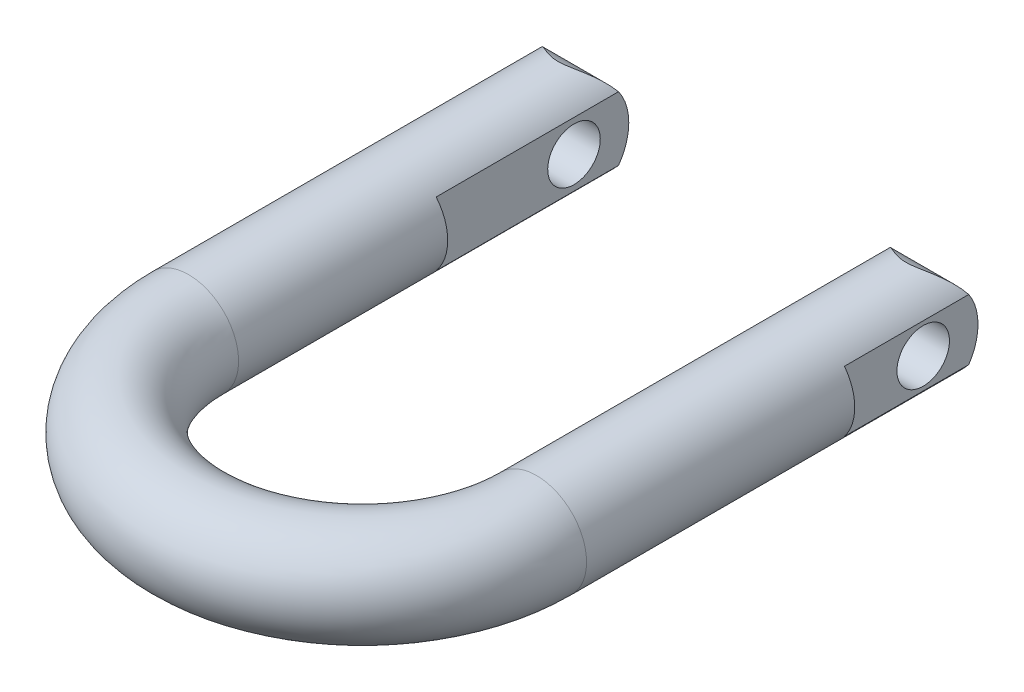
ISO-10303-21;
HEADER;
FILE_DESCRIPTION(('STEP AP214'),'2;1');
FILE_NAME('part.step','',(''),(''),'','','');
FILE_SCHEMA(('AUTOMOTIVE_DESIGN { 1 0 10303 214 1 1 1 1 }'));
ENDSEC;
DATA;
#1=APPLICATION_CONTEXT('core data for automotive mechanical design processes');
#2=APPLICATION_PROTOCOL_DEFINITION('international standard','automotive_design',2000,#1);
#3=PRODUCT_CONTEXT('',#1,'mechanical');
#4=PRODUCT('Part','Part','',(#3));
#5=PRODUCT_RELATED_PRODUCT_CATEGORY('part','',(#4));
#6=PRODUCT_DEFINITION_FORMATION('','',#4);
#7=PRODUCT_DEFINITION_CONTEXT('part definition',#1,'design');
#8=PRODUCT_DEFINITION('design','',#6,#7);
#9=PRODUCT_DEFINITION_SHAPE('','',#8);
#10=(LENGTH_UNIT() NAMED_UNIT(*) SI_UNIT(.MILLI.,.METRE.));
#11=(NAMED_UNIT(*) PLANE_ANGLE_UNIT() SI_UNIT($,.RADIAN.));
#12=(NAMED_UNIT(*) SI_UNIT($,.STERADIAN.) SOLID_ANGLE_UNIT());
#13=UNCERTAINTY_MEASURE_WITH_UNIT(LENGTH_MEASURE(1.E-05),#10,'distance_accuracy_value','');
#14=(GEOMETRIC_REPRESENTATION_CONTEXT(3) GLOBAL_UNCERTAINTY_ASSIGNED_CONTEXT((#13)) GLOBAL_UNIT_ASSIGNED_CONTEXT((#10,
#11,#12)) REPRESENTATION_CONTEXT('',''));
#15=CARTESIAN_POINT('',(0.,0.,0.));
#16=DIRECTION('',(0.,0.,1.));
#17=DIRECTION('',(1.,0.,0.));
#18=AXIS2_PLACEMENT_3D('',#15,#16,#17);
#19=CARTESIAN_POINT('',(40.165,-20.,-10.6));
#20=DIRECTION('',(1.,0.,0.));
#21=DIRECTION('',(0.,1.,0.));
#22=AXIS2_PLACEMENT_3D('',#19,#20,#21);
#23=PLANE('',#22);
#24=DIRECTION('',(0.,1.,0.));
#25=VECTOR('',#24,1.);
#26=CARTESIAN_POINT('',(40.165,-20.,14.8));
#27=LINE('',#26,#25);
#28=CARTESIAN_POINT('',(40.165,-5.71259792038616,14.8));
#29=VERTEX_POINT('',#28);
#30=CARTESIAN_POINT('',(40.165,5.71259792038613,14.8));
#31=VERTEX_POINT('',#30);
#32=EDGE_CURVE('E181',#29,#31,#27,.T.);
#33=ORIENTED_EDGE('',*,*,#32,.F.);
#34=DIRECTION('',(0.,0.,-1.));
#35=VECTOR('',#34,1.);
#36=CARTESIAN_POINT('',(40.165,-5.71259792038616,67.3));
#37=LINE('',#36,#35);
#38=CARTESIAN_POINT('',(40.165,-5.71259792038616,-8.57066070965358));
#39=VERTEX_POINT('',#38);
#40=EDGE_CURVE('E126',#39,#29,#37,.F.);
#41=ORIENTED_EDGE('',*,*,#40,.F.);
#42=CARTESIAN_POINT('',(40.165,0.,0.));
#43=DIRECTION('',(1.,0.,0.));
#44=DIRECTION('',(0.,1.,0.));
#45=AXIS2_PLACEMENT_3D('',#42,#43,#44);
#46=CIRCLE('',#45,10.3);
#47=CARTESIAN_POINT('',(40.165,5.71259792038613,-8.5706607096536));
#48=VERTEX_POINT('',#47);
#49=EDGE_CURVE('E118',#39,#48,#46,.T.);
#50=ORIENTED_EDGE('',*,*,#49,.T.);
#51=DIRECTION('',(0.,0.,-1.));
#52=VECTOR('',#51,1.);
#53=CARTESIAN_POINT('',(40.165,5.71259792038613,67.3));
#54=LINE('',#53,#52);
#55=EDGE_CURVE('E179',#31,#48,#54,.T.);
#56=ORIENTED_EDGE('',*,*,#55,.F.);
#57=EDGE_LOOP('',(#33,#41,#50,#56));
#58=FACE_BOUND('',#57,.T.);
#59=CARTESIAN_POINT('',(40.165,0.,0.));
#60=DIRECTION('',(-1.,0.,0.));
#61=DIRECTION('',(0.,0.,1.));
#62=AXIS2_PLACEMENT_3D('',#59,#60,#61);
#63=CIRCLE('',#62,4.94);
#64=CARTESIAN_POINT('',(40.165,0.,4.94));
#65=VERTEX_POINT('',#64);
#66=EDGE_CURVE('E165',#65,#65,#63,.T.);
#67=ORIENTED_EDGE('',*,*,#66,.T.);
#68=EDGE_LOOP('',(#67));
#69=FACE_BOUND('',#68,.T.);
#70=ADVANCED_FACE('F14',(#58,#69),#23,.T.);
#71=CARTESIAN_POINT('',(25.465,20.,25.9));
#72=DIRECTION('',(1.,0.,0.));
#73=DIRECTION('',(0.,1.,0.));
#74=AXIS2_PLACEMENT_3D('',#71,#72,#73);
#75=PLANE('',#74);
#76=CARTESIAN_POINT('',(25.465,0.,0.));
#77=DIRECTION('',(-1.,0.,0.));
#78=DIRECTION('',(0.,-1.,0.));
#79=AXIS2_PLACEMENT_3D('',#76,#77,#78);
#80=CIRCLE('',#79,4.94);
#81=CARTESIAN_POINT('',(25.465,-4.94,0.));
#82=VERTEX_POINT('',#81);
#83=EDGE_CURVE('E162',#82,#82,#80,.T.);
#84=ORIENTED_EDGE('',*,*,#83,.F.);
#85=EDGE_LOOP('',(#84));
#86=FACE_BOUND('',#85,.T.);
#87=CARTESIAN_POINT('',(25.465,0.,0.));
#88=DIRECTION('',(1.,0.,0.));
#89=DIRECTION('',(0.,1.,0.));
#90=AXIS2_PLACEMENT_3D('',#87,#88,#89);
#91=CIRCLE('',#90,10.3);
#92=CARTESIAN_POINT('',(25.465,-6.00123112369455,-8.37109461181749));
#93=VERTEX_POINT('',#92);
#94=CARTESIAN_POINT('',(25.465,6.00123112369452,-8.37109461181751));
#95=VERTEX_POINT('',#94);
#96=EDGE_CURVE('E24',#93,#95,#91,.T.);
#97=ORIENTED_EDGE('',*,*,#96,.F.);
#98=DIRECTION('',(0.,0.,-1.));
#99=VECTOR('',#98,1.);
#100=CARTESIAN_POINT('',(25.465,-6.00123112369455,67.3));
#101=LINE('',#100,#99);
#102=CARTESIAN_POINT('',(25.465,-6.00123112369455,25.9));
#103=VERTEX_POINT('',#102);
#104=EDGE_CURVE('E167',#93,#103,#101,.F.);
#105=ORIENTED_EDGE('',*,*,#104,.T.);
#106=DIRECTION('',(0.,1.,0.));
#107=VECTOR('',#106,1.);
#108=CARTESIAN_POINT('',(25.465,-20.,25.9));
#109=LINE('',#108,#107);
#110=CARTESIAN_POINT('',(25.465,6.00123112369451,25.9));
#111=VERTEX_POINT('',#110);
#112=EDGE_CURVE('E168',#103,#111,#109,.T.);
#113=ORIENTED_EDGE('',*,*,#112,.T.);
#114=DIRECTION('',(0.,0.,-1.));
#115=VECTOR('',#114,1.);
#116=CARTESIAN_POINT('',(25.465,6.00123112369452,67.3));
#117=LINE('',#116,#115);
#118=EDGE_CURVE('E177',#111,#95,#117,.T.);
#119=ORIENTED_EDGE('',*,*,#118,.T.);
#120=EDGE_LOOP('',(#97,#105,#113,#119));
#121=FACE_BOUND('',#120,.T.);
#122=ADVANCED_FACE('F136',(#86,#121),#75,.F.);
#123=CARTESIAN_POINT('',(32.7,0.,67.3));
#124=DIRECTION('',(0.,0.,-1.));
#125=DIRECTION('',(1.,0.,0.));
#126=AXIS2_PLACEMENT_3D('',#123,#124,#125);
#127=CYLINDRICAL_SURFACE('',#126,9.4);
#128=CARTESIAN_POINT('',(32.7,0.,65.2));
#129=DIRECTION('',(0.,0.,-1.));
#130=DIRECTION('',(-1.,0.,0.));
#131=AXIS2_PLACEMENT_3D('',#128,#129,#130);
#132=CIRCLE('',#131,9.4);
#133=CARTESIAN_POINT('',(42.1,0.,65.2));
#134=VERTEX_POINT('',#133);
#135=EDGE_CURVE('E9',#134,#134,#132,.F.);
#136=ORIENTED_EDGE('',*,*,#135,.F.);
#137=EDGE_LOOP('',(#136));
#138=FACE_BOUND('',#137,.T.);
#139=ORIENTED_EDGE('',*,*,#55,.T.);
#140=CARTESIAN_POINT('',(42.1,0.,-10.3));
#141=CARTESIAN_POINT('',(42.0999992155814,0.216897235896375,-10.299999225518));
#142=CARTESIAN_POINT('',(42.0924791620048,0.433805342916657,-10.2931349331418));
#143=CARTESIAN_POINT('',(42.0625521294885,0.865733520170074,-10.2658338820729));
#144=CARTESIAN_POINT('',(42.040144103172,1.08075345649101,-10.245396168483));
#145=CARTESIAN_POINT('',(41.9808762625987,1.50721883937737,-10.1913941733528));
#146=CARTESIAN_POINT('',(41.9440092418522,1.71866244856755,-10.1578233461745));
#147=CARTESIAN_POINT('',(41.8565179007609,2.13628254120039,-10.0782681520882));
#148=CARTESIAN_POINT('',(41.805893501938,2.34245899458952,-10.0322837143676));
#149=CARTESIAN_POINT('',(41.6921337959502,2.74688376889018,-9.92914389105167));
#150=CARTESIAN_POINT('',(41.6290833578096,2.94517547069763,-9.87206431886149));
#151=CARTESIAN_POINT('',(41.4911872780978,3.33431563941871,-9.74751751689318));
#152=CARTESIAN_POINT('',(41.4163372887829,3.52516133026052,-9.68004645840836));
#153=CARTESIAN_POINT('',(41.2558382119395,3.8985812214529,-9.53578156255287));
#154=CARTESIAN_POINT('',(41.1701893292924,4.08115557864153,-9.45898790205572));
#155=CARTESIAN_POINT('',(40.989035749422,4.43755176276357,-9.29712110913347));
#156=CARTESIAN_POINT('',(40.8935288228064,4.61137159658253,-9.21204610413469));
#157=CARTESIAN_POINT('',(40.6535187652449,5.01770116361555,-8.99912622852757));
#158=CARTESIAN_POINT('',(40.5047058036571,5.24585357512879,-8.86779237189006));
#159=CARTESIAN_POINT('',(40.1917278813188,5.68388185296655,-8.59361889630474));
#160=CARTESIAN_POINT('',(40.0275618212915,5.89375640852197,-8.45077845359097));
#161=CARTESIAN_POINT('',(39.6852676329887,6.29570269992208,-8.15575902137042));
#162=CARTESIAN_POINT('',(39.5071095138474,6.48773415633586,-8.00356013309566));
#163=CARTESIAN_POINT('',(39.1385307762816,6.85366806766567,-7.69252175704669));
#164=CARTESIAN_POINT('',(38.9481117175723,7.02757282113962,-7.5336831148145));
#165=CARTESIAN_POINT('',(38.5511551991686,7.36158208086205,-7.20783144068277));
#166=CARTESIAN_POINT('',(38.3443400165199,7.52125342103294,-7.04071367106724));
#167=CARTESIAN_POINT('',(37.9191259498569,7.82231549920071,-6.70464528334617));
#168=CARTESIAN_POINT('',(37.7007242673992,7.96370179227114,-6.53569423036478));
#169=CARTESIAN_POINT('',(37.2525679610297,8.22810501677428,-6.1995086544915));
#170=CARTESIAN_POINT('',(37.0228348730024,8.35115513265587,-6.03227155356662));
#171=CARTESIAN_POINT('',(36.5507764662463,8.5790568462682,-5.70348246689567));
#172=CARTESIAN_POINT('',(36.308458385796,8.68391875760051,-5.54192730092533));
#173=CARTESIAN_POINT('',(35.8136389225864,8.87322878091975,-5.23334914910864));
#174=CARTESIAN_POINT('',(35.5613971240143,8.95800840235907,-5.08611795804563));
#175=CARTESIAN_POINT('',(35.040169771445,9.10808419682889,-4.81217978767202));
#176=CARTESIAN_POINT('',(34.7711889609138,9.1733858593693,-4.68546703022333));
#177=CARTESIAN_POINT('',(34.2611933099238,9.27243230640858,-4.48580034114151));
#178=CARTESIAN_POINT('',(34.0231085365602,9.30964118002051,-4.40738476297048));
#179=CARTESIAN_POINT('',(33.6580389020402,9.35185345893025,-4.31670500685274));
#180=CARTESIAN_POINT('',(33.5351566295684,9.36365217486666,-4.29098176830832));
#181=CARTESIAN_POINT('',(33.2873596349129,9.38245268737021,-4.24971800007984));
#182=CARTESIAN_POINT('',(33.1624460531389,9.38945708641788,-4.23417194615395));
#183=CARTESIAN_POINT('',(32.9103095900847,9.39850185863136,-4.2140585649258));
#184=CARTESIAN_POINT('',(32.7830760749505,9.40049289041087,-4.20960036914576));
#185=CARTESIAN_POINT('',(32.5287590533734,9.39930037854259,-4.21226243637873));
#186=CARTESIAN_POINT('',(32.4016755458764,9.3961168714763,-4.21938261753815));
#187=CARTESIAN_POINT('',(32.1486647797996,9.38467327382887,-4.24477247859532));
#188=CARTESIAN_POINT('',(32.0227397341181,9.37640494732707,-4.26306024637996));
#189=CARTESIAN_POINT('',(31.7731680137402,9.35503621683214,-4.30975212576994));
#190=CARTESIAN_POINT('',(31.6495228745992,9.3419326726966,-4.33816281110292));
#191=CARTESIAN_POINT('',(31.2055925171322,9.28610737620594,-4.45725929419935));
#192=CARTESIAN_POINT('',(30.8937981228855,9.22995459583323,-4.57389542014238));
#193=CARTESIAN_POINT('',(30.4432094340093,9.12638679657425,-4.77544661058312));
#194=CARTESIAN_POINT('',(30.2955418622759,9.08853087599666,-4.84726047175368));
#195=CARTESIAN_POINT('',(30.0053380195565,9.00674403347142,-4.99758721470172));
#196=CARTESIAN_POINT('',(29.86280100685,8.96281399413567,-5.07609912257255));
#197=CARTESIAN_POINT('',(29.4473431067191,8.82409552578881,-5.31590803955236));
#198=CARTESIAN_POINT('',(29.1811443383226,8.72109263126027,-5.48407135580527));
#199=CARTESIAN_POINT('',(28.6639241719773,8.49410443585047,-5.82950413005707));
#200=CARTESIAN_POINT('',(28.412915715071,8.37010157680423,-6.00678112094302));
#201=CARTESIAN_POINT('',(27.9242429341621,8.10123433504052,-6.36476257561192));
#202=CARTESIAN_POINT('',(27.6865985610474,7.95633985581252,-6.54547165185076));
#203=CARTESIAN_POINT('',(27.2245756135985,7.64572836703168,-6.90575383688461));
#204=CARTESIAN_POINT('',(27.0001928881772,7.48001792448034,-7.08532728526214));
#205=CARTESIAN_POINT('',(26.5503556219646,7.1155584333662,-7.451846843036));
#206=CARTESIAN_POINT('',(26.3258323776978,6.91534122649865,-7.63848320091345));
#207=CARTESIAN_POINT('',(25.8933896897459,6.49014619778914,-8.0029012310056));
#208=CARTESIAN_POINT('',(25.6854749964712,6.26516133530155,-8.18068036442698));
#209=CARTESIAN_POINT('',(25.289149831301,5.79089739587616,-8.52295542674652));
#210=CARTESIAN_POINT('',(25.1006784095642,5.54169930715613,-8.68749248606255));
#211=CARTESIAN_POINT('',(24.7455256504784,5.01857682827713,-8.9998071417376));
#212=CARTESIAN_POINT('',(24.5788286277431,4.74467048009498,-9.14759679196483));
#213=CARTESIAN_POINT('',(24.3282024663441,4.27954972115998,-9.37097041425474));
#214=CARTESIAN_POINT('',(24.236563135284,4.09551120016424,-9.45295287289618));
#215=CARTESIAN_POINT('',(24.0643041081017,3.71855681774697,-9.60748628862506));
#216=CARTESIAN_POINT('',(23.9836810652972,3.52564367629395,-9.68004010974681));
#217=CARTESIAN_POINT('',(23.8345200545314,3.13170926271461,-9.81456560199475));
#218=CARTESIAN_POINT('',(23.765976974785,2.93069146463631,-9.87654174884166));
#219=CARTESIAN_POINT('',(23.6419685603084,2.52146188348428,-9.98885590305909));
#220=CARTESIAN_POINT('',(23.5865036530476,2.31324986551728,-10.0391935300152));
#221=CARTESIAN_POINT('',(23.4892593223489,1.88940879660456,-10.1275529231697));
#222=CARTESIAN_POINT('',(23.4475823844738,1.67373681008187,-10.1654824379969));
#223=CARTESIAN_POINT('',(23.3792808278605,1.2380650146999,-10.2276882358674));
#224=CARTESIAN_POINT('',(23.3526561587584,1.01806522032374,-10.2519645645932));
#225=CARTESIAN_POINT('',(23.3150220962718,0.57571082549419,-10.286289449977));
#226=CARTESIAN_POINT('',(23.3040066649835,0.353357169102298,-10.296343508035));
#227=CARTESIAN_POINT('',(23.2978136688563,-0.0917444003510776,-10.3019952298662));
#228=CARTESIAN_POINT('',(23.3026347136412,-0.314492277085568,-10.2975941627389));
#229=CARTESIAN_POINT('',(23.3266394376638,-0.73451388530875,-10.2756930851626));
#230=CARTESIAN_POINT('',(23.3442279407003,-0.931958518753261,-10.2596479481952));
#231=CARTESIAN_POINT('',(23.3916428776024,-1.32420678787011,-10.2164287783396));
#232=CARTESIAN_POINT('',(23.4214734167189,-1.51900951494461,-10.1892510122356));
#233=CARTESIAN_POINT('',(23.4928808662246,-1.90457083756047,-10.1242690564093));
#234=CARTESIAN_POINT('',(23.5344541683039,-2.09533065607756,-10.0864681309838));
#235=CARTESIAN_POINT('',(23.6287450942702,-2.47184559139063,-10.0008637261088));
#236=CARTESIAN_POINT('',(23.6814669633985,-2.65759877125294,-9.95305643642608));
#237=CARTESIAN_POINT('',(23.7988570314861,-3.02792993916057,-9.84681193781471));
#238=CARTESIAN_POINT('',(23.8638021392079,-3.2123495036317,-9.78812894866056));
#239=CARTESIAN_POINT('',(24.0038568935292,-3.57418276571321,-9.66188338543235));
#240=CARTESIAN_POINT('',(24.0789704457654,-3.75159373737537,-9.59431739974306));
#241=CARTESIAN_POINT('',(24.3183385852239,-4.27242065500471,-9.37961774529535));
#242=CARTESIAN_POINT('',(24.4966739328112,-4.60459532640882,-9.22043391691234));
#243=CARTESIAN_POINT('',(24.8364737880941,-5.15780573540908,-8.91966629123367));
#244=CARTESIAN_POINT('',(24.9912444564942,-5.38604134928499,-8.78343054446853));
#245=CARTESIAN_POINT('',(25.3163486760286,-5.82374254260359,-8.49953057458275));
#246=CARTESIAN_POINT('',(25.4866889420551,-6.03319994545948,-8.35186142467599));
#247=CARTESIAN_POINT('',(25.8415058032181,-6.43372820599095,-8.04739779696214));
#248=CARTESIAN_POINT('',(26.0260166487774,-6.6247518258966,-7.89058144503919));
#249=CARTESIAN_POINT('',(26.4074669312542,-6.98808960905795,-7.57067814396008));
#250=CARTESIAN_POINT('',(26.6044044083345,-7.16040671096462,-7.4075921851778));
#251=CARTESIAN_POINT('',(27.0147472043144,-7.49058815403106,-7.07371919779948));
#252=CARTESIAN_POINT('',(27.2284327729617,-7.64801133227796,-6.90284126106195));
#253=CARTESIAN_POINT('',(27.6678104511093,-7.94400885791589,-6.56003014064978));
#254=CARTESIAN_POINT('',(27.8935063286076,-8.08257724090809,-6.38809664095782));
#255=CARTESIAN_POINT('',(28.3567986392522,-8.34067094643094,-6.04721273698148));
#256=CARTESIAN_POINT('',(28.5943683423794,-8.46023671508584,-5.87825669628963));
#257=CARTESIAN_POINT('',(29.0830314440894,-8.68040055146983,-5.54796552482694));
#258=CARTESIAN_POINT('',(29.3341147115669,-8.78101258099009,-5.38662485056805));
#259=CARTESIAN_POINT('',(29.8326166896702,-8.95558230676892,-5.09065475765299));
#260=CARTESIAN_POINT('',(30.0788632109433,-9.03098474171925,-4.95492715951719));
#261=CARTESIAN_POINT('',(30.5873120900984,-9.16326994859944,-4.70577138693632));
#262=CARTESIAN_POINT('',(30.8495011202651,-9.22016794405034,-4.59232491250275));
#263=CARTESIAN_POINT('',(31.3460243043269,-9.30477633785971,-4.41803998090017));
#264=CARTESIAN_POINT('',(31.5777160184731,-9.33577116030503,-4.3515843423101));
#265=CARTESIAN_POINT('',(31.9317029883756,-9.36930045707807,-4.27865654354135));
#266=CARTESIAN_POINT('',(32.0506735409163,-9.37831430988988,-4.25881188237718));
#267=CARTESIAN_POINT('',(32.2900729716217,-9.39182106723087,-4.22894506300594));
#268=CARTESIAN_POINT('',(32.4105011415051,-9.39631608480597,-4.21891831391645));
#269=CARTESIAN_POINT('',(32.6526102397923,-9.40066523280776,-4.20921868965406));
#270=CARTESIAN_POINT('',(32.7742943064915,-9.4004904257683,-4.20961037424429));
#271=CARTESIAN_POINT('',(33.0170716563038,-9.39543553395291,-4.22087996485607));
#272=CARTESIAN_POINT('',(33.1381649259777,-9.3905553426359,-4.23175810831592));
#273=CARTESIAN_POINT('',(33.3789811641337,-9.37622340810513,-4.26341789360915));
#274=CARTESIAN_POINT('',(33.4987012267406,-9.366763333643,-4.28421758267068));
#275=CARTESIAN_POINT('',(33.7358433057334,-9.3435131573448,-4.33468917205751));
#276=CARTESIAN_POINT('',(33.8532643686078,-9.32972129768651,-4.36436467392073));
#277=CARTESIAN_POINT('',(34.13571258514,-9.29122873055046,-4.44588348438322));
#278=CARTESIAN_POINT('',(34.299283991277,-9.26439135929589,-4.50175807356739));
#279=CARTESIAN_POINT('',(34.6203347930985,-9.20320955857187,-4.62554800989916));
#280=CARTESIAN_POINT('',(34.7778105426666,-9.16886071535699,-4.69347043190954));
#281=CARTESIAN_POINT('',(35.0873754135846,-9.09317955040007,-4.83846984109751));
#282=CARTESIAN_POINT('',(35.2394447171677,-9.05182421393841,-4.91557674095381));
#283=CARTESIAN_POINT('',(35.5381490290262,-8.96265567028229,-5.07634572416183));
#284=CARTESIAN_POINT('',(35.684781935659,-8.91483999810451,-5.1600103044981));
#285=CARTESIAN_POINT('',(36.1097561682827,-8.76483836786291,-5.41343532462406));
#286=CARTESIAN_POINT('',(36.3812395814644,-8.65406611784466,-5.58965572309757));
#287=CARTESIAN_POINT('',(36.9085052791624,-8.41028051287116,-5.9501915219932));
#288=CARTESIAN_POINT('',(37.164274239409,-8.27724863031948,-6.13451357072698));
#289=CARTESIAN_POINT('',(37.6614976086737,-7.98912235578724,-6.50531138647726));
#290=CARTESIAN_POINT('',(37.9029498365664,-7.83402461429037,-6.69178747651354));
#291=CARTESIAN_POINT('',(38.3717294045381,-7.50159899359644,-7.06243545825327));
#292=CARTESIAN_POINT('',(38.5990628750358,-7.32428086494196,-7.24660832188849));
#293=CARTESIAN_POINT('',(39.0120720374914,-6.97010468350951,-7.58685275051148));
#294=CARTESIAN_POINT('',(39.1994356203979,-6.795862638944,-7.74359842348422));
#295=CARTESIAN_POINT('',(39.5620059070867,-6.42956288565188,-8.05032824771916));
#296=CARTESIAN_POINT('',(39.7372115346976,-6.23750360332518,-8.20031180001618));
#297=CARTESIAN_POINT('',(40.0737898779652,-5.83573285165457,-8.49091229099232));
#298=CARTESIAN_POINT('',(40.2351859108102,-5.62605237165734,-8.63154492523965));
#299=CARTESIAN_POINT('',(40.5426732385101,-5.18881924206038,-8.90124013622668));
#300=CARTESIAN_POINT('',(40.6887702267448,-4.96127329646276,-9.03030701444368));
#301=CARTESIAN_POINT('',(40.9305588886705,-4.54544323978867,-9.24498783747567));
#302=CARTESIAN_POINT('',(41.0299339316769,-4.36083839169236,-9.33359743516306));
#303=CARTESIAN_POINT('',(41.2175147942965,-3.98203110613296,-9.50138407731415));
#304=CARTESIAN_POINT('',(41.3057270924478,-3.78783432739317,-9.58056659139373));
#305=CARTESIAN_POINT('',(41.4698679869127,-3.3905147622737,-9.7282734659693));
#306=CARTESIAN_POINT('',(41.5458030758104,-3.1873967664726,-9.79680345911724));
#307=CARTESIAN_POINT('',(41.6842985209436,-2.77309625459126,-9.92203329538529));
#308=CARTESIAN_POINT('',(41.7468602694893,-2.56191458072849,-9.97873437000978));
#309=CARTESIAN_POINT('',(41.8507663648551,-2.15900854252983,-10.0730387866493));
#310=CARTESIAN_POINT('',(41.8937690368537,-1.96805886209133,-10.1121289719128));
#311=CARTESIAN_POINT('',(41.9679966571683,-1.58204077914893,-10.1796622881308));
#312=CARTESIAN_POINT('',(41.9992232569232,-1.38697295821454,-10.2081069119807));
#313=CARTESIAN_POINT('',(42.0493953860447,-0.993998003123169,-10.2538328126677));
#314=CARTESIAN_POINT('',(42.0683431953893,-0.796091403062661,-10.2711161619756));
#315=CARTESIAN_POINT('',(42.0936463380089,-0.398793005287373,-10.2942005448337));
#316=CARTESIAN_POINT('',(42.100000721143,-0.199401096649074,-10.300000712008));
#317=CARTESIAN_POINT('',(42.1,0.,-10.3));
#318=B_SPLINE_CURVE_WITH_KNOTS('',3,(#140,#141,#142,#143,#144,#145,#146,#147,#148,#149,#150,
#151,#152,#153,#154,#155,#156,#157,#158,#159,#160,#161,#162,#163,#164,#165,#166,#167,#168,#169,
#170,#171,#172,#173,#174,#175,#176,#177,#178,#179,#180,#181,#182,#183,#184,#185,#186,#187,#188,
#189,#190,#191,#192,#193,#194,#195,#196,#197,#198,#199,#200,#201,#202,#203,#204,#205,#206,#207,
#208,#209,#210,#211,#212,#213,#214,#215,#216,#217,#218,#219,#220,#221,#222,#223,#224,#225,#226,
#227,#228,#229,#230,#231,#232,#233,#234,#235,#236,#237,#238,#239,#240,#241,#242,#243,#244,#245,
#246,#247,#248,#249,#250,#251,#252,#253,#254,#255,#256,#257,#258,#259,#260,#261,#262,#263,#264,
#265,#266,#267,#268,#269,#270,#271,#272,#273,#274,#275,#276,#277,#278,#279,#280,#281,#282,#283,
#284,#285,#286,#287,#288,#289,#290,#291,#292,#293,#294,#295,#296,#297,#298,#299,#300,#301,#302,
#303,#304,#305,#306,#307,#308,#309,#310,#311,#312,#313,#314,#315,#316,#317),.UNSPECIFIED.,.T.,
.F.,(4,2,2,2,2,2,2,2,2,2,2,2,2,2,2,2,2,2,2,2,2,2,2,2,2,2,2,2,2,2,2,2,2,2,2,2,2,2,2,2,2,2,2,2,2,
2,2,2,2,2,2,2,2,2,2,2,2,2,2,2,2,2,2,2,2,2,2,2,2,2,2,2,2,2,2,2,2,2,2,2,2,2,2,2,2,2,2,2,4),(0.,
0.650474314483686,1.30099439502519,1.95183911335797,2.60268754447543,3.24923584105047,
3.89602292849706,4.5427977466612,5.18971915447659,6.09558698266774,7.0015197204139,
7.90945022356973,8.81726545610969,9.7469416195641,10.6768433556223,11.6050411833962,
12.5327109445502,13.443792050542,14.3546161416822,15.1118884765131,15.4897428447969,
15.8673919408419,16.2487435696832,16.6300925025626,17.0120607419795,17.3942774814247,
18.4004344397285,18.9058582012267,19.411208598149,20.4035526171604,21.3967304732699,
22.3913536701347,23.3856638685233,24.4464505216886,25.5075395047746,26.5651941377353,
27.6220826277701,28.2855204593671,28.9487562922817,29.6117107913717,30.2746869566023,
30.942485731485,31.6102822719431,32.2778204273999,32.9452999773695,33.5412214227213,
34.1373428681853,34.7332813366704,35.3294471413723,35.9412393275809,36.553267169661,
37.7767884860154,38.6984287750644,39.6204684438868,40.54481142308,41.4690089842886,
42.4151853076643,43.361660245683,44.3060928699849,45.2498270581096,46.1218254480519,
46.9931046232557,47.7191429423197,48.0815693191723,48.4438261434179,48.808328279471,
49.1728386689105,49.5380146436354,49.9033389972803,50.4272129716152,50.9513956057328,
51.4773346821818,52.0034750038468,53.0281729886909,54.0537281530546,55.079439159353,
56.1047016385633,57.0040957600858,57.9035693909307,58.8014930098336,59.6990812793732,
60.381306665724,61.0631342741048,61.7446001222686,62.4259949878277,63.0241483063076,
63.6222177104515,64.2201760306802,64.8181794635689),.UNSPECIFIED.);
#319=EDGE_CURVE('E127',#48,#95,#318,.T.);
#320=ORIENTED_EDGE('',*,*,#319,.T.);
#321=ORIENTED_EDGE('',*,*,#118,.F.);
#322=CARTESIAN_POINT('',(32.7,0.,25.9));
#323=DIRECTION('',(0.,0.,1.));
#324=DIRECTION('',(0.,-1.,0.));
#325=AXIS2_PLACEMENT_3D('',#322,#323,#324);
#326=CIRCLE('',#325,9.4);
#327=EDGE_CURVE('E128',#103,#111,#326,.F.);
#328=ORIENTED_EDGE('',*,*,#327,.F.);
#329=ORIENTED_EDGE('',*,*,#104,.F.);
#330=EDGE_CURVE('E119',#93,#39,#318,.T.);
#331=ORIENTED_EDGE('',*,*,#330,.T.);
#332=ORIENTED_EDGE('',*,*,#40,.T.);
#333=CARTESIAN_POINT('',(32.7,0.,14.8));
#334=DIRECTION('',(0.,0.,-1.));
#335=DIRECTION('',(0.,1.,0.));
#336=AXIS2_PLACEMENT_3D('',#333,#334,#335);
#337=CIRCLE('',#336,9.4);
#338=EDGE_CURVE('E184',#29,#31,#337,.F.);
#339=ORIENTED_EDGE('',*,*,#338,.T.);
#340=EDGE_LOOP('',(#139,#320,#321,#328,#329,#331,#332,#339));
#341=FACE_BOUND('',#340,.T.);
#342=ADVANCED_FACE('F130',(#138,#341),#127,.T.);
#343=CARTESIAN_POINT('',(40.165,-20.,14.8));
#344=DIRECTION('',(0.,0.,-1.));
#345=DIRECTION('',(0.,1.,0.));
#346=AXIS2_PLACEMENT_3D('',#343,#344,#345);
#347=PLANE('',#346);
#348=ORIENTED_EDGE('',*,*,#32,.T.);
#349=ORIENTED_EDGE('',*,*,#338,.F.);
#350=EDGE_LOOP('',(#348,#349));
#351=FACE_BOUND('',#350,.T.);
#352=ADVANCED_FACE('F135',(#351),#347,.T.);
#353=CARTESIAN_POINT('',(25.465,-20.,25.9));
#354=DIRECTION('',(0.,0.,1.));
#355=DIRECTION('',(0.,-1.,0.));
#356=AXIS2_PLACEMENT_3D('',#353,#354,#355);
#357=PLANE('',#356);
#358=ORIENTED_EDGE('',*,*,#112,.F.);
#359=ORIENTED_EDGE('',*,*,#327,.T.);
#360=EDGE_LOOP('',(#358,#359));
#361=FACE_BOUND('',#360,.T.);
#362=ADVANCED_FACE('F142',(#361),#357,.F.);
#363=CARTESIAN_POINT('',(25.465,0.,0.));
#364=DIRECTION('',(1.,0.,0.));
#365=DIRECTION('',(0.,1.,0.));
#366=AXIS2_PLACEMENT_3D('',#363,#364,#365);
#367=CYLINDRICAL_SURFACE('',#366,4.94);
#368=ORIENTED_EDGE('',*,*,#83,.T.);
#369=EDGE_LOOP('',(#368));
#370=FACE_BOUND('',#369,.T.);
#371=ORIENTED_EDGE('',*,*,#66,.F.);
#372=EDGE_LOOP('',(#371));
#373=FACE_BOUND('',#372,.T.);
#374=ADVANCED_FACE('F149',(#370,#373),#367,.F.);
#375=CARTESIAN_POINT('',(25.465,0.,0.));
#376=DIRECTION('',(1.,0.,0.));
#377=DIRECTION('',(0.,1.,0.));
#378=AXIS2_PLACEMENT_3D('',#375,#376,#377);
#379=CYLINDRICAL_SURFACE('',#378,10.3);
#380=ORIENTED_EDGE('',*,*,#49,.F.);
#381=ORIENTED_EDGE('',*,*,#330,.F.);
#382=ORIENTED_EDGE('',*,*,#96,.T.);
#383=ORIENTED_EDGE('',*,*,#319,.F.);
#384=EDGE_LOOP('',(#380,#381,#382,#383));
#385=FACE_BOUND('',#384,.T.);
#386=ADVANCED_FACE('F16',(#385),#379,.T.);
#387=CARTESIAN_POINT('',(0.,0.,65.2));
#388=DIRECTION('',(0.,1.,0.));
#389=DIRECTION('',(0.,0.,1.));
#390=AXIS2_PLACEMENT_3D('',#387,#388,#389);
#391=TOROIDAL_SURFACE('',#390,32.7,9.4);
#392=CARTESIAN_POINT('',(-32.7,0.,65.2));
#393=DIRECTION('',(0.,0.,1.));
#394=DIRECTION('',(1.,0.,0.));
#395=AXIS2_PLACEMENT_3D('',#392,#393,#394);
#396=CIRCLE('',#395,9.4);
#397=CARTESIAN_POINT('',(-42.1,0.,65.2));
#398=VERTEX_POINT('',#397);
#399=EDGE_CURVE('E115',#398,#398,#396,.T.);
#400=CARTESIAN_POINT('',(0.,0.,65.2));
#401=DIRECTION('',(0.,1.,0.));
#402=DIRECTION('',(0.,0.,1.));
#403=AXIS2_PLACEMENT_3D('',#400,#401,#402);
#404=CIRCLE('',#403,42.1);
#405=EDGE_CURVE('',#398,#134,#404,.T.);
#406=ORIENTED_EDGE('',*,*,#399,.T.);
#407=ORIENTED_EDGE('',*,*,#135,.T.);
#408=ORIENTED_EDGE('',*,*,#405,.T.);
#409=ORIENTED_EDGE('',*,*,#405,.F.);
#410=EDGE_LOOP('',(#406,#408,#407,#409));
#411=FACE_BOUND('',#410,.T.);
#412=ADVANCED_FACE('F138',(#411),#391,.T.);
#413=CARTESIAN_POINT('',(-25.465,0.,0.));
#414=DIRECTION('',(-1.,0.,0.));
#415=DIRECTION('',(0.,-1.,0.));
#416=AXIS2_PLACEMENT_3D('',#413,#414,#415);
#417=CYLINDRICAL_SURFACE('',#416,4.94);
#418=CARTESIAN_POINT('',(-25.465,0.,0.));
#419=DIRECTION('',(-1.,0.,0.));
#420=DIRECTION('',(0.,-1.,0.));
#421=AXIS2_PLACEMENT_3D('',#418,#419,#420);
#422=CIRCLE('',#421,4.94);
#423=CARTESIAN_POINT('',(-25.465,-4.94,0.));
#424=VERTEX_POINT('',#423);
#425=EDGE_CURVE('E227',#424,#424,#422,.T.);
#426=ORIENTED_EDGE('',*,*,#425,.F.);
#427=EDGE_LOOP('',(#426));
#428=FACE_BOUND('',#427,.T.);
#429=CARTESIAN_POINT('',(-40.165,0.,0.));
#430=DIRECTION('',(1.,0.,0.));
#431=DIRECTION('',(0.,0.,-1.));
#432=AXIS2_PLACEMENT_3D('',#429,#430,#431);
#433=CIRCLE('',#432,4.94);
#434=CARTESIAN_POINT('',(-40.165,0.,-4.94));
#435=VERTEX_POINT('',#434);
#436=EDGE_CURVE('E244',#435,#435,#433,.F.);
#437=ORIENTED_EDGE('',*,*,#436,.T.);
#438=EDGE_LOOP('',(#437));
#439=FACE_BOUND('',#438,.T.);
#440=ADVANCED_FACE('F200',(#428,#439),#417,.F.);
#441=CARTESIAN_POINT('',(-25.465,-20.,25.9));
#442=DIRECTION('',(0.,0.,-1.));
#443=DIRECTION('',(0.,1.,0.));
#444=AXIS2_PLACEMENT_3D('',#441,#442,#443);
#445=PLANE('',#444);
#446=DIRECTION('',(0.,1.,0.));
#447=VECTOR('',#446,1.);
#448=CARTESIAN_POINT('',(-25.465,-20.,25.9));
#449=LINE('',#448,#447);
#450=CARTESIAN_POINT('',(-25.465,-6.00123112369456,25.9));
#451=VERTEX_POINT('',#450);
#452=CARTESIAN_POINT('',(-25.465,6.00123112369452,25.9));
#453=VERTEX_POINT('',#452);
#454=EDGE_CURVE('E99',#451,#453,#449,.T.);
#455=ORIENTED_EDGE('',*,*,#454,.T.);
#456=CARTESIAN_POINT('',(-32.7,0.,25.9));
#457=DIRECTION('',(0.,0.,-1.));
#458=DIRECTION('',(0.,1.,0.));
#459=AXIS2_PLACEMENT_3D('',#456,#457,#458);
#460=CIRCLE('',#459,9.4);
#461=EDGE_CURVE('E113',#453,#451,#460,.T.);
#462=ORIENTED_EDGE('',*,*,#461,.T.);
#463=EDGE_LOOP('',(#455,#462));
#464=FACE_BOUND('',#463,.T.);
#465=ADVANCED_FACE('F205',(#464),#445,.T.);
#466=CARTESIAN_POINT('',(-40.165,-20.,14.8));
#467=DIRECTION('',(0.,0.,1.));
#468=DIRECTION('',(0.,-1.,0.));
#469=AXIS2_PLACEMENT_3D('',#466,#467,#468);
#470=PLANE('',#469);
#471=DIRECTION('',(0.,1.,0.));
#472=VECTOR('',#471,1.);
#473=CARTESIAN_POINT('',(-40.165,-20.,14.8));
#474=LINE('',#473,#472);
#475=CARTESIAN_POINT('',(-40.165,-5.71259792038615,14.8));
#476=VERTEX_POINT('',#475);
#477=CARTESIAN_POINT('',(-40.165,5.71259792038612,14.8));
#478=VERTEX_POINT('',#477);
#479=EDGE_CURVE('E100',#476,#478,#474,.T.);
#480=ORIENTED_EDGE('',*,*,#479,.F.);
#481=CARTESIAN_POINT('',(-32.7,0.,14.8));
#482=DIRECTION('',(0.,0.,1.));
#483=DIRECTION('',(0.,-1.,0.));
#484=AXIS2_PLACEMENT_3D('',#481,#482,#483);
#485=CIRCLE('',#484,9.4);
#486=EDGE_CURVE('E111',#478,#476,#485,.T.);
#487=ORIENTED_EDGE('',*,*,#486,.F.);
#488=EDGE_LOOP('',(#480,#487));
#489=FACE_BOUND('',#488,.T.);
#490=ADVANCED_FACE('F219',(#489),#470,.F.);
#491=CARTESIAN_POINT('',(-40.165,-20.,14.8));
#492=DIRECTION('',(1.,0.,0.));
#493=DIRECTION('',(0.,1.,0.));
#494=AXIS2_PLACEMENT_3D('',#491,#492,#493);
#495=PLANE('',#494);
#496=CARTESIAN_POINT('',(-40.165,0.,0.));
#497=DIRECTION('',(1.,0.,0.));
#498=DIRECTION('',(0.,1.,0.));
#499=AXIS2_PLACEMENT_3D('',#496,#497,#498);
#500=CIRCLE('',#499,10.3);
#501=CARTESIAN_POINT('',(-40.165,-5.71259792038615,-8.57066070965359));
#502=VERTEX_POINT('',#501);
#503=CARTESIAN_POINT('',(-40.165,5.71259792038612,-8.57066070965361));
#504=VERTEX_POINT('',#503);
#505=EDGE_CURVE('E85',#502,#504,#500,.T.);
#506=ORIENTED_EDGE('',*,*,#505,.F.);
#507=DIRECTION('',(0.,0.,-1.));
#508=VECTOR('',#507,1.);
#509=CARTESIAN_POINT('',(-40.165,-5.71259792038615,67.3));
#510=LINE('',#509,#508);
#511=EDGE_CURVE('E93',#476,#502,#510,.T.);
#512=ORIENTED_EDGE('',*,*,#511,.F.);
#513=ORIENTED_EDGE('',*,*,#479,.T.);
#514=DIRECTION('',(0.,0.,-1.));
#515=VECTOR('',#514,1.);
#516=CARTESIAN_POINT('',(-40.165,5.71259792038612,67.3));
#517=LINE('',#516,#515);
#518=EDGE_CURVE('E104',#504,#478,#517,.F.);
#519=ORIENTED_EDGE('',*,*,#518,.F.);
#520=EDGE_LOOP('',(#506,#512,#513,#519));
#521=FACE_BOUND('',#520,.T.);
#522=ORIENTED_EDGE('',*,*,#436,.F.);
#523=EDGE_LOOP('',(#522));
#524=FACE_BOUND('',#523,.T.);
#525=ADVANCED_FACE('F230',(#521,#524),#495,.F.);
#526=CARTESIAN_POINT('',(-25.465,0.,0.));
#527=DIRECTION('',(-1.,0.,0.));
#528=DIRECTION('',(0.,-1.,0.));
#529=AXIS2_PLACEMENT_3D('',#526,#527,#528);
#530=CYLINDRICAL_SURFACE('',#529,10.3);
#531=CARTESIAN_POINT('',(-25.465,0.,0.));
#532=DIRECTION('',(1.,0.,0.));
#533=DIRECTION('',(0.,1.,0.));
#534=AXIS2_PLACEMENT_3D('',#531,#532,#533);
#535=CIRCLE('',#534,10.3);
#536=CARTESIAN_POINT('',(-25.465,-6.00123112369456,-8.37109461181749));
#537=VERTEX_POINT('',#536);
#538=CARTESIAN_POINT('',(-25.465,6.00123112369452,-8.37109461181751));
#539=VERTEX_POINT('',#538);
#540=EDGE_CURVE('E75',#537,#539,#535,.T.);
#541=ORIENTED_EDGE('',*,*,#540,.F.);
#542=CARTESIAN_POINT('',(-23.3,0.,-10.3));
#543=CARTESIAN_POINT('',(-23.3000007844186,0.216897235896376,-10.299999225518));
#544=CARTESIAN_POINT('',(-23.3075208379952,0.433805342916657,-10.2931349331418));
#545=CARTESIAN_POINT('',(-23.3374478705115,0.865733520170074,-10.2658338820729));
#546=CARTESIAN_POINT('',(-23.359855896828,1.08075345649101,-10.245396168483));
#547=CARTESIAN_POINT('',(-23.4191237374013,1.50721883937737,-10.1913941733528));
#548=CARTESIAN_POINT('',(-23.4559907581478,1.71866244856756,-10.1578233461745));
#549=CARTESIAN_POINT('',(-23.5434820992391,2.1362825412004,-10.0782681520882));
#550=CARTESIAN_POINT('',(-23.5941064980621,2.34245899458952,-10.0322837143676));
#551=CARTESIAN_POINT('',(-23.7078662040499,2.74688376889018,-9.92914389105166));
#552=CARTESIAN_POINT('',(-23.7709166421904,2.94517547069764,-9.87206431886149));
#553=CARTESIAN_POINT('',(-23.9088127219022,3.33431563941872,-9.74751751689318));
#554=CARTESIAN_POINT('',(-23.9836627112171,3.52516133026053,-9.68004645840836));
#555=CARTESIAN_POINT('',(-24.1441617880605,3.89858122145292,-9.53578156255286));
#556=CARTESIAN_POINT('',(-24.2298106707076,4.08115557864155,-9.45898790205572));
#557=CARTESIAN_POINT('',(-24.4109642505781,4.43755176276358,-9.29712110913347));
#558=CARTESIAN_POINT('',(-24.5064711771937,4.61137159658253,-9.21204610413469));
#559=CARTESIAN_POINT('',(-24.7464812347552,5.01770116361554,-8.99912622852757));
#560=CARTESIAN_POINT('',(-24.8952941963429,5.24585357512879,-8.86779237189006));
#561=CARTESIAN_POINT('',(-25.2082721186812,5.68388185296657,-8.59361889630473));
#562=CARTESIAN_POINT('',(-25.3724381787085,5.89375640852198,-8.45077845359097));
#563=CARTESIAN_POINT('',(-25.7147323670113,6.2957026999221,-8.15575902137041));
#564=CARTESIAN_POINT('',(-25.8928904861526,6.48773415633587,-8.00356013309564));
#565=CARTESIAN_POINT('',(-26.2614692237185,6.85366806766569,-7.69252175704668));
#566=CARTESIAN_POINT('',(-26.4518882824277,7.02757282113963,-7.5336831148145));
#567=CARTESIAN_POINT('',(-26.8488448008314,7.36158208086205,-7.20783144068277));
#568=CARTESIAN_POINT('',(-27.0556599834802,7.52125342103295,-7.04071367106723));
#569=CARTESIAN_POINT('',(-27.4808740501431,7.82231549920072,-6.70464528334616));
#570=CARTESIAN_POINT('',(-27.6992757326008,7.96370179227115,-6.53569423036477));
#571=CARTESIAN_POINT('',(-28.1474320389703,8.22810501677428,-6.19950865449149));
#572=CARTESIAN_POINT('',(-28.3771651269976,8.35115513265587,-6.03227155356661));
#573=CARTESIAN_POINT('',(-28.8492235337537,8.5790568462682,-5.70348246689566));
#574=CARTESIAN_POINT('',(-29.091541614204,8.68391875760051,-5.54192730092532));
#575=CARTESIAN_POINT('',(-29.5863610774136,8.87322878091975,-5.23334914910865));
#576=CARTESIAN_POINT('',(-29.8386028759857,8.95800840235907,-5.08611795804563));
#577=CARTESIAN_POINT('',(-30.359830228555,9.10808419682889,-4.81217978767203));
#578=CARTESIAN_POINT('',(-30.6288110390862,9.1733858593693,-4.68546703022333));
#579=CARTESIAN_POINT('',(-31.1388066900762,9.27243230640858,-4.48580034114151));
#580=CARTESIAN_POINT('',(-31.3768914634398,9.30964118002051,-4.40738476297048));
#581=CARTESIAN_POINT('',(-31.7419610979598,9.35185345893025,-4.31670500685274));
#582=CARTESIAN_POINT('',(-31.8648433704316,9.36365217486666,-4.29098176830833));
#583=CARTESIAN_POINT('',(-32.1126403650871,9.38245268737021,-4.24971800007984));
#584=CARTESIAN_POINT('',(-32.2375539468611,9.38945708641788,-4.23417194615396));
#585=CARTESIAN_POINT('',(-32.4896904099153,9.39850185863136,-4.2140585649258));
#586=CARTESIAN_POINT('',(-32.6169239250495,9.40049289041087,-4.20960036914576));
#587=CARTESIAN_POINT('',(-32.8712409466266,9.39930037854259,-4.21226243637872));
#588=CARTESIAN_POINT('',(-32.9983244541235,9.3961168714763,-4.21938261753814));
#589=CARTESIAN_POINT('',(-33.2513352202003,9.38467327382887,-4.24477247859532));
#590=CARTESIAN_POINT('',(-33.3772602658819,9.37640494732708,-4.26306024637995));
#591=CARTESIAN_POINT('',(-33.6268319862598,9.35503621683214,-4.30975212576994));
#592=CARTESIAN_POINT('',(-33.7504771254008,9.3419326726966,-4.33816281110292));
#593=CARTESIAN_POINT('',(-34.1944074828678,9.28610737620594,-4.45725929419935));
#594=CARTESIAN_POINT('',(-34.5062018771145,9.22995459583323,-4.57389542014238));
#595=CARTESIAN_POINT('',(-34.9567905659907,9.12638679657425,-4.77544661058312));
#596=CARTESIAN_POINT('',(-35.1044581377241,9.08853087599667,-4.84726047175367));
#597=CARTESIAN_POINT('',(-35.3946619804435,9.00674403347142,-4.99758721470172));
#598=CARTESIAN_POINT('',(-35.53719899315,8.96281399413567,-5.07609912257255));
#599=CARTESIAN_POINT('',(-35.9526568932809,8.82409552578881,-5.31590803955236));
#600=CARTESIAN_POINT('',(-36.2188556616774,8.72109263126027,-5.48407135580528));
#601=CARTESIAN_POINT('',(-36.7360758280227,8.49410443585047,-5.82950413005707));
#602=CARTESIAN_POINT('',(-36.987084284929,8.37010157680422,-6.00678112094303));
#603=CARTESIAN_POINT('',(-37.4757570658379,8.10123433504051,-6.36476257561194));
#604=CARTESIAN_POINT('',(-37.7134014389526,7.9563398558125,-6.54547165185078));
#605=CARTESIAN_POINT('',(-38.1754243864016,7.64572836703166,-6.90575383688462));
#606=CARTESIAN_POINT('',(-38.3998071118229,7.48001792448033,-7.08532728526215));
#607=CARTESIAN_POINT('',(-38.8496443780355,7.11555843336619,-7.45184684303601));
#608=CARTESIAN_POINT('',(-39.0741676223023,6.91534122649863,-7.63848320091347));
#609=CARTESIAN_POINT('',(-39.5066103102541,6.49014619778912,-8.00290123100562));
#610=CARTESIAN_POINT('',(-39.7145250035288,6.26516133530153,-8.18068036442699));
#611=CARTESIAN_POINT('',(-40.110850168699,5.79089739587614,-8.52295542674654));
#612=CARTESIAN_POINT('',(-40.2993215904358,5.54169930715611,-8.68749248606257));
#613=CARTESIAN_POINT('',(-40.6544743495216,5.01857682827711,-8.99980714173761));
#614=CARTESIAN_POINT('',(-40.821171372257,4.74467048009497,-9.14759679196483));
#615=CARTESIAN_POINT('',(-41.071797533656,4.27954972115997,-9.37097041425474));
#616=CARTESIAN_POINT('',(-41.163436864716,4.09551120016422,-9.45295287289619));
#617=CARTESIAN_POINT('',(-41.3356958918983,3.71855681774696,-9.60748628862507));
#618=CARTESIAN_POINT('',(-41.4163189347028,3.52564367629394,-9.68004010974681));
#619=CARTESIAN_POINT('',(-41.5654799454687,3.1317092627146,-9.81456560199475));
#620=CARTESIAN_POINT('',(-41.634023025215,2.9306914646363,-9.87654174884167));
#621=CARTESIAN_POINT('',(-41.7580314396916,2.52146188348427,-9.9888559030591));
#622=CARTESIAN_POINT('',(-41.8134963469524,2.31324986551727,-10.0391935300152));
#623=CARTESIAN_POINT('',(-41.9107406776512,1.88940879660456,-10.1275529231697));
#624=CARTESIAN_POINT('',(-41.9524176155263,1.67373681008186,-10.1654824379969));
#625=CARTESIAN_POINT('',(-42.0207191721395,1.23806501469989,-10.2276882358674));
#626=CARTESIAN_POINT('',(-42.0473438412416,1.01806522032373,-10.2519645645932));
#627=CARTESIAN_POINT('',(-42.0849779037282,0.575710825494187,-10.286289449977));
#628=CARTESIAN_POINT('',(-42.0959933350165,0.353357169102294,-10.296343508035));
#629=CARTESIAN_POINT('',(-42.1021863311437,-0.091744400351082,-10.3019952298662));
#630=CARTESIAN_POINT('',(-42.0973652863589,-0.314492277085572,-10.2975941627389));
#631=CARTESIAN_POINT('',(-42.0733605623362,-0.73451388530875,-10.2756930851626));
#632=CARTESIAN_POINT('',(-42.0557720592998,-0.931958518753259,-10.2596479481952));
#633=CARTESIAN_POINT('',(-42.0083571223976,-1.3242067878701,-10.2164287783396));
#634=CARTESIAN_POINT('',(-41.9785265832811,-1.51900951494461,-10.1892510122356));
#635=CARTESIAN_POINT('',(-41.9071191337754,-1.90457083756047,-10.1242690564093));
#636=CARTESIAN_POINT('',(-41.8655458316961,-2.09533065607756,-10.0864681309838));
#637=CARTESIAN_POINT('',(-41.7712549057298,-2.47184559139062,-10.0008637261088));
#638=CARTESIAN_POINT('',(-41.7185330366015,-2.65759877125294,-9.95305643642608));
#639=CARTESIAN_POINT('',(-41.601142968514,-3.02792993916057,-9.84681193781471));
#640=CARTESIAN_POINT('',(-41.5361978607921,-3.21234950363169,-9.78812894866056));
#641=CARTESIAN_POINT('',(-41.3961431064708,-3.5741827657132,-9.66188338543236));
#642=CARTESIAN_POINT('',(-41.3210295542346,-3.75159373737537,-9.59431739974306));
#643=CARTESIAN_POINT('',(-41.0816614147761,-4.27242065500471,-9.37961774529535));
#644=CARTESIAN_POINT('',(-40.9033260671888,-4.60459532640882,-9.22043391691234));
#645=CARTESIAN_POINT('',(-40.5635262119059,-5.15780573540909,-8.91966629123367));
#646=CARTESIAN_POINT('',(-40.4087555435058,-5.386041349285,-8.78343054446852));
#647=CARTESIAN_POINT('',(-40.0836513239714,-5.82374254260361,-8.49953057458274));
#648=CARTESIAN_POINT('',(-39.9133110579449,-6.03319994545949,-8.35186142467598));
#649=CARTESIAN_POINT('',(-39.5584941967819,-6.43372820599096,-8.04739779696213));
#650=CARTESIAN_POINT('',(-39.3739833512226,-6.62475182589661,-7.89058144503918));
#651=CARTESIAN_POINT('',(-38.9925330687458,-6.98808960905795,-7.57067814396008));
#652=CARTESIAN_POINT('',(-38.7955955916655,-7.16040671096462,-7.4075921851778));
#653=CARTESIAN_POINT('',(-38.3852527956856,-7.49058815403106,-7.07371919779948));
#654=CARTESIAN_POINT('',(-38.1715672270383,-7.64801133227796,-6.90284126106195));
#655=CARTESIAN_POINT('',(-37.7321895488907,-7.94400885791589,-6.56003014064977));
#656=CARTESIAN_POINT('',(-37.5064936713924,-8.08257724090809,-6.38809664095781));
#657=CARTESIAN_POINT('',(-37.0432013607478,-8.34067094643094,-6.04721273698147));
#658=CARTESIAN_POINT('',(-36.8056316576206,-8.46023671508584,-5.87825669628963));
#659=CARTESIAN_POINT('',(-36.3169685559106,-8.68040055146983,-5.54796552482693));
#660=CARTESIAN_POINT('',(-36.0658852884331,-8.78101258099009,-5.38662485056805));
#661=CARTESIAN_POINT('',(-35.5673833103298,-8.95558230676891,-5.090654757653));
#662=CARTESIAN_POINT('',(-35.3211367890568,-9.03098474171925,-4.9549271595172));
#663=CARTESIAN_POINT('',(-34.8126879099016,-9.16326994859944,-4.70577138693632));
#664=CARTESIAN_POINT('',(-34.5504988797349,-9.22016794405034,-4.59232491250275));
#665=CARTESIAN_POINT('',(-34.0539756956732,-9.30477633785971,-4.41803998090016));
#666=CARTESIAN_POINT('',(-33.8222839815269,-9.33577116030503,-4.3515843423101));
#667=CARTESIAN_POINT('',(-33.4682970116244,-9.36930045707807,-4.27865654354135));
#668=CARTESIAN_POINT('',(-33.3493264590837,-9.37831430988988,-4.25881188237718));
#669=CARTESIAN_POINT('',(-33.1099270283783,-9.39182106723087,-4.22894506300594));
#670=CARTESIAN_POINT('',(-32.9894988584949,-9.39631608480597,-4.21891831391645));
#671=CARTESIAN_POINT('',(-32.7473897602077,-9.40066523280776,-4.20921868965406));
#672=CARTESIAN_POINT('',(-32.6257056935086,-9.4004904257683,-4.20961037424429));
#673=CARTESIAN_POINT('',(-32.3829283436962,-9.39543553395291,-4.22087996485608));
#674=CARTESIAN_POINT('',(-32.2618350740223,-9.3905553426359,-4.23175810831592));
#675=CARTESIAN_POINT('',(-32.0210188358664,-9.37622340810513,-4.26341789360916));
#676=CARTESIAN_POINT('',(-31.9012987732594,-9.366763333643,-4.28421758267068));
#677=CARTESIAN_POINT('',(-31.6641566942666,-9.3435131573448,-4.33468917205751));
#678=CARTESIAN_POINT('',(-31.5467356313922,-9.32972129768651,-4.36436467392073));
#679=CARTESIAN_POINT('',(-31.26428741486,-9.29122873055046,-4.44588348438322));
#680=CARTESIAN_POINT('',(-31.100716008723,-9.26439135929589,-4.50175807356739));
#681=CARTESIAN_POINT('',(-30.7796652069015,-9.20320955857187,-4.62554800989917));
#682=CARTESIAN_POINT('',(-30.6221894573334,-9.16886071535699,-4.69347043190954));
#683=CARTESIAN_POINT('',(-30.3126245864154,-9.09317955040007,-4.8384698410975));
#684=CARTESIAN_POINT('',(-30.1605552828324,-9.05182421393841,-4.91557674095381));
#685=CARTESIAN_POINT('',(-29.8618509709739,-8.96265567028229,-5.07634572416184));
#686=CARTESIAN_POINT('',(-29.715218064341,-8.91483999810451,-5.1600103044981));
#687=CARTESIAN_POINT('',(-29.2902438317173,-8.76483836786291,-5.41343532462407));
#688=CARTESIAN_POINT('',(-29.0187604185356,-8.65406611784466,-5.58965572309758));
#689=CARTESIAN_POINT('',(-28.4914947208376,-8.41028051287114,-5.95019152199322));
#690=CARTESIAN_POINT('',(-28.235725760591,-8.27724863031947,-6.134513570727));
#691=CARTESIAN_POINT('',(-27.7385023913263,-7.98912235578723,-6.50531138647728));
#692=CARTESIAN_POINT('',(-27.4970501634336,-7.83402461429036,-6.69178747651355));
#693=CARTESIAN_POINT('',(-27.0282705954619,-7.50159899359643,-7.06243545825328));
#694=CARTESIAN_POINT('',(-26.8009371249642,-7.32428086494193,-7.24660832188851));
#695=CARTESIAN_POINT('',(-26.3879279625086,-6.97010468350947,-7.5868527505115));
#696=CARTESIAN_POINT('',(-26.2005643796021,-6.79586263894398,-7.74359842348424));
#697=CARTESIAN_POINT('',(-25.8379940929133,-6.42956288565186,-8.05032824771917));
#698=CARTESIAN_POINT('',(-25.6627884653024,-6.23750360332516,-8.20031180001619));
#699=CARTESIAN_POINT('',(-25.3262101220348,-5.83573285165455,-8.49091229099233));
#700=CARTESIAN_POINT('',(-25.1648140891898,-5.62605237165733,-8.63154492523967));
#701=CARTESIAN_POINT('',(-24.8573267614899,-5.18881924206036,-8.90124013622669));
#702=CARTESIAN_POINT('',(-24.7112297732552,-4.96127329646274,-9.03030701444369));
#703=CARTESIAN_POINT('',(-24.4694411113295,-4.54544323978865,-9.24498783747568));
#704=CARTESIAN_POINT('',(-24.3700660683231,-4.36083839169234,-9.33359743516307));
#705=CARTESIAN_POINT('',(-24.1824852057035,-3.98203110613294,-9.50138407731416));
#706=CARTESIAN_POINT('',(-24.0942729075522,-3.78783432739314,-9.58056659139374));
#707=CARTESIAN_POINT('',(-23.9301320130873,-3.39051476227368,-9.72827346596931));
#708=CARTESIAN_POINT('',(-23.8541969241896,-3.18739676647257,-9.79680345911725));
#709=CARTESIAN_POINT('',(-23.7157014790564,-2.77309625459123,-9.92203329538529));
#710=CARTESIAN_POINT('',(-23.6531397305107,-2.56191458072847,-9.97873437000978));
#711=CARTESIAN_POINT('',(-23.5492336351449,-2.15900854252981,-10.0730387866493));
#712=CARTESIAN_POINT('',(-23.5062309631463,-1.96805886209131,-10.1121289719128));
#713=CARTESIAN_POINT('',(-23.4320033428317,-1.58204077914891,-10.1796622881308));
#714=CARTESIAN_POINT('',(-23.4007767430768,-1.38697295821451,-10.2081069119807));
#715=CARTESIAN_POINT('',(-23.3506046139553,-0.99399800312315,-10.2538328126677));
#716=CARTESIAN_POINT('',(-23.3316568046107,-0.796091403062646,-10.2711161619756));
#717=CARTESIAN_POINT('',(-23.3063536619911,-0.398793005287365,-10.2942005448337));
#718=CARTESIAN_POINT('',(-23.299999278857,-0.19940109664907,-10.300000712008));
#719=CARTESIAN_POINT('',(-23.3,0.,-10.3));
#720=B_SPLINE_CURVE_WITH_KNOTS('',3,(#542,#543,#544,#545,#546,#547,#548,#549,#550,#551,#552,
#553,#554,#555,#556,#557,#558,#559,#560,#561,#562,#563,#564,#565,#566,#567,#568,#569,#570,#571,
#572,#573,#574,#575,#576,#577,#578,#579,#580,#581,#582,#583,#584,#585,#586,#587,#588,#589,#590,
#591,#592,#593,#594,#595,#596,#597,#598,#599,#600,#601,#602,#603,#604,#605,#606,#607,#608,#609,
#610,#611,#612,#613,#614,#615,#616,#617,#618,#619,#620,#621,#622,#623,#624,#625,#626,#627,#628,
#629,#630,#631,#632,#633,#634,#635,#636,#637,#638,#639,#640,#641,#642,#643,#644,#645,#646,#647,
#648,#649,#650,#651,#652,#653,#654,#655,#656,#657,#658,#659,#660,#661,#662,#663,#664,#665,#666,
#667,#668,#669,#670,#671,#672,#673,#674,#675,#676,#677,#678,#679,#680,#681,#682,#683,#684,#685,
#686,#687,#688,#689,#690,#691,#692,#693,#694,#695,#696,#697,#698,#699,#700,#701,#702,#703,#704,
#705,#706,#707,#708,#709,#710,#711,#712,#713,#714,#715,#716,#717,#718,#719),.UNSPECIFIED.,.T.,
.F.,(4,2,2,2,2,2,2,2,2,2,2,2,2,2,2,2,2,2,2,2,2,2,2,2,2,2,2,2,2,2,2,2,2,2,2,2,2,2,2,2,2,2,2,2,2,
2,2,2,2,2,2,2,2,2,2,2,2,2,2,2,2,2,2,2,2,2,2,2,2,2,2,2,2,2,2,2,2,2,2,2,2,2,2,2,2,2,2,2,4),(0.,
0.650474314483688,1.30099439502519,1.95183911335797,2.60268754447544,3.24923584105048,
3.89602292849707,4.54279774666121,5.18971915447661,6.09558698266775,7.00151972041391,
7.90945022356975,8.81726545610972,9.74694161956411,10.6768433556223,11.6050411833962,
12.5327109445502,13.443792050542,14.3546161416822,15.1118884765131,15.4897428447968,
15.8673919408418,16.2487435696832,16.6300925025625,17.0120607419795,17.3942774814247,
18.4004344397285,18.9058582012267,19.411208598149,20.4035526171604,21.3967304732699,
22.3913536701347,23.3856638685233,24.4464505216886,25.5075395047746,26.5651941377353,
27.6220826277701,28.2855204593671,28.9487562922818,29.6117107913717,30.2746869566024,
30.942485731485,31.6102822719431,32.2778204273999,32.9452999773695,33.5412214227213,
34.1373428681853,34.7332813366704,35.3294471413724,35.9412393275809,36.553267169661,
37.7767884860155,38.6984287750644,39.6204684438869,40.54481142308,41.4690089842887,
42.4151853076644,43.361660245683,44.3060928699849,45.2498270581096,46.1218254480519,
46.9931046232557,47.7191429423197,48.0815693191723,48.443826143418,48.808328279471,
49.1728386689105,49.5380146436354,49.9033389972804,50.4272129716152,50.9513956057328,
51.4773346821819,52.0034750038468,53.028172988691,54.0537281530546,55.079439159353,
56.1047016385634,57.0040957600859,57.9035693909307,58.8014930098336,59.6990812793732,
60.381306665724,61.0631342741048,61.7446001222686,62.4259949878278,63.0241483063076,
63.6222177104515,64.2201760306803,64.8181794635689),.UNSPECIFIED.);
#721=EDGE_CURVE('E78',#502,#537,#720,.T.);
#722=ORIENTED_EDGE('',*,*,#721,.F.);
#723=ORIENTED_EDGE('',*,*,#505,.T.);
#724=EDGE_CURVE('E81',#539,#504,#720,.T.);
#725=ORIENTED_EDGE('',*,*,#724,.F.);
#726=EDGE_LOOP('',(#541,#722,#723,#725));
#727=FACE_BOUND('',#726,.T.);
#728=ADVANCED_FACE('F77',(#727),#530,.T.);
#729=CARTESIAN_POINT('',(-25.465,20.,-10.6));
#730=DIRECTION('',(1.,0.,0.));
#731=DIRECTION('',(0.,1.,0.));
#732=AXIS2_PLACEMENT_3D('',#729,#730,#731);
#733=PLANE('',#732);
#734=ORIENTED_EDGE('',*,*,#540,.T.);
#735=DIRECTION('',(0.,0.,-1.));
#736=VECTOR('',#735,1.);
#737=CARTESIAN_POINT('',(-25.465,6.00123112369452,67.3));
#738=LINE('',#737,#736);
#739=EDGE_CURVE('E101',#539,#453,#738,.F.);
#740=ORIENTED_EDGE('',*,*,#739,.T.);
#741=ORIENTED_EDGE('',*,*,#454,.F.);
#742=DIRECTION('',(0.,0.,-1.));
#743=VECTOR('',#742,1.);
#744=CARTESIAN_POINT('',(-25.465,-6.00123112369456,67.3));
#745=LINE('',#744,#743);
#746=EDGE_CURVE('E91',#451,#537,#745,.T.);
#747=ORIENTED_EDGE('',*,*,#746,.T.);
#748=EDGE_LOOP('',(#734,#740,#741,#747));
#749=FACE_BOUND('',#748,.T.);
#750=ORIENTED_EDGE('',*,*,#425,.T.);
#751=EDGE_LOOP('',(#750));
#752=FACE_BOUND('',#751,.T.);
#753=ADVANCED_FACE('F96',(#749,#752),#733,.T.);
#754=CARTESIAN_POINT('',(-32.7,0.,67.3));
#755=DIRECTION('',(0.,0.,-1.));
#756=DIRECTION('',(1.,0.,0.));
#757=AXIS2_PLACEMENT_3D('',#754,#755,#756);
#758=CYLINDRICAL_SURFACE('',#757,9.4);
#759=ORIENTED_EDGE('',*,*,#399,.F.);
#760=EDGE_LOOP('',(#759));
#761=FACE_BOUND('',#760,.T.);
#762=ORIENTED_EDGE('',*,*,#739,.F.);
#763=ORIENTED_EDGE('',*,*,#724,.T.);
#764=ORIENTED_EDGE('',*,*,#518,.T.);
#765=ORIENTED_EDGE('',*,*,#486,.T.);
#766=ORIENTED_EDGE('',*,*,#511,.T.);
#767=ORIENTED_EDGE('',*,*,#721,.T.);
#768=ORIENTED_EDGE('',*,*,#746,.F.);
#769=ORIENTED_EDGE('',*,*,#461,.F.);
#770=EDGE_LOOP('',(#762,#763,#764,#765,#766,#767,#768,#769));
#771=FACE_BOUND('',#770,.T.);
#772=ADVANCED_FACE('F89',(#761,#771),#758,.T.);
#773=CLOSED_SHELL('',(#70,#122,#342,#352,#362,#374,#386,#412,#440,#465,#490,#525,#728,#753,#772));
#774=MANIFOLD_SOLID_BREP('B1',#773);
#775=ADVANCED_BREP_SHAPE_REPRESENTATION('',(#18,#774),#14);
#776=SHAPE_DEFINITION_REPRESENTATION(#9,#775);
ENDSEC;
END-ISO-10303-21;
